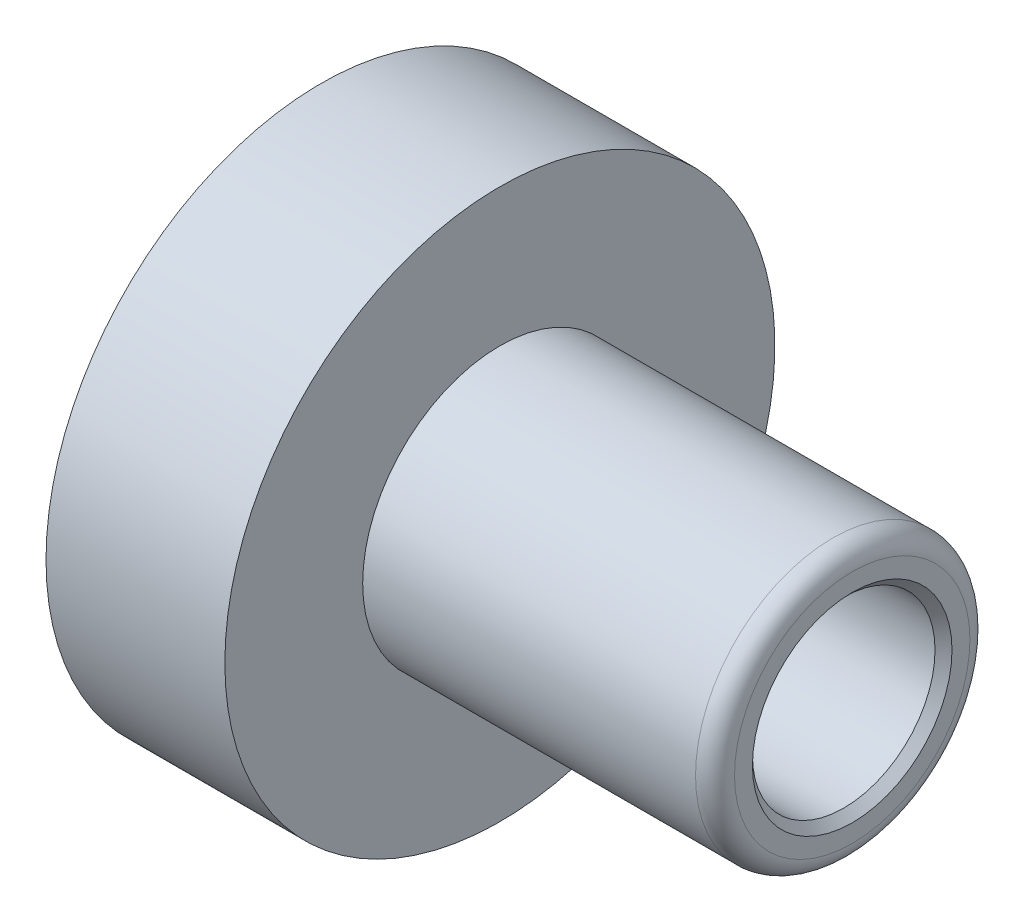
from build123d import *

# Parameters (mm, degrees)
SKETCH2_R          = 3.2004
CUT_EXTRUDE1_DEPTH = 7.9502
SKETCH3_R          = 7.3787
CUT_EXTRUDE2_DEPTH = 54.202845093
CHAMFER1_SIZE      = 0.6858


with BuildPart() as part:
    # Sketch1 → Revolve1 (revolve)
    with BuildSketch(Plane.XY, mode=Mode.PRIVATE) as revolve1_sk:
        with BuildLine():
            Line((0, 8.128), (0, 22.225))
            Line((0, 22.225), (14.4526, 22.225))
            Line((14.4526, 22.225), (14.4526, 11.0871))
            Line((14.4526, 11.0871), (41.3512, 11.0871))
            ThreePointArc((41.3512, 11.0871), (42.464751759, 10.625851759), (42.926, 9.5123))
            Line((42.926, 9.5123), (42.926, 0))
            Line((42.926, 0), (28.067, 0))
            Line((28.067, 0), (28.067, 8.128))
            Line((28.067, 8.128), (0, 8.128))
        make_face()
    revolve(revolve1_sk.sketch.rotate(Axis((0, 0, 0), (1, 0, 0)), 90), axis=Axis((0, 0, 0), (1, 0, 0)))

    # Sketch2 → Cut-Extrude1 (cut)
    with BuildSketch(Plane.ZY):
        with Locations((-12.7, 0)):
            Circle(SKETCH2_R)
        with Locations(Location((12.7, 0, 0), (0, 0, 180))):
            Circle(SKETCH2_R)
    extrude(amount=-CUT_EXTRUDE1_DEPTH, mode=Mode.SUBTRACT)

    # Sketch3 → Cut-Extrude2 (cut, through all)
    with BuildSketch(Plane(origin=(42.926, 0, 0), x_dir=(0, 0, -1), z_dir=(1, 0, 0))):
        Circle(SKETCH3_R)
    extrude(amount=-CUT_EXTRUDE2_DEPTH, mode=Mode.SUBTRACT)

    # Chamfer1
    chamfer1_edges = [part.edges().sort_by_distance(p)[0] for p in [
        (42.926, 0, 7.3787),
    ]]
    chamfer(chamfer1_edges, length=CHAMFER1_SIZE)


solid = part.part
